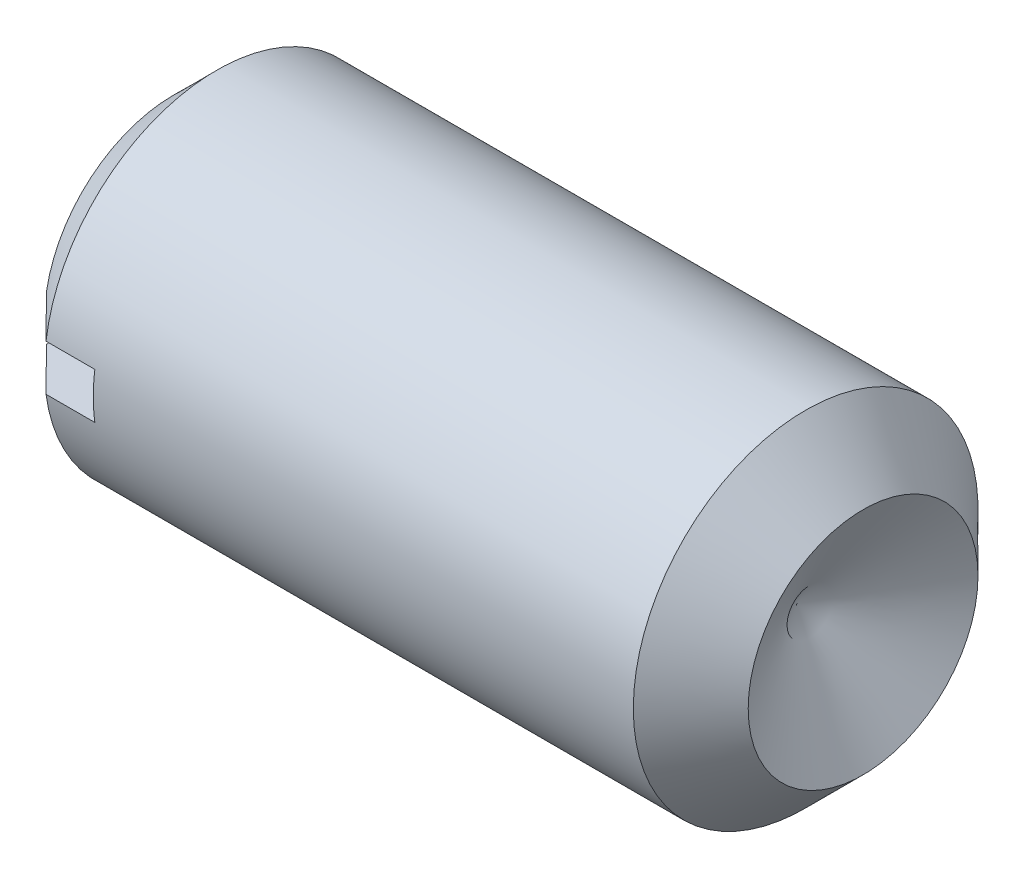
from build123d import *

# Parameters (mm, degrees)
NOTCH_DEPTH      = 7.363961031
NOTCH_DEPTH_BACK = 7.363961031
SKETCH2_W        = 0.8
SKETCH2_H        = 0.4


with BuildPart() as part:
    # Sketch1 → Base (revolve)
    with BuildSketch(Plane.XY, mode=Mode.PRIVATE) as base_sk:
        Polygon((0, 0), (5.422649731, 0), (6, 1), (5.5, 1.5), (0.375, 1.5), (0, 1.125), align=None)
    revolve(base_sk.sketch.rotate(Axis((-10.745014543, 0, 0), (1, 0, 0)), 90), axis=Axis((-10.745014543, 0, 0), (1, 0, 0)))

    # Sketch2 → Notch (cut, two sides: drawn at the far end of the back side and taken through both)
    with BuildSketch(Plane.XY.offset(-NOTCH_DEPTH_BACK)):
        with Locations((0.4, 0)):
            Rectangle(SKETCH2_W, SKETCH2_H)
    extrude(amount=NOTCH_DEPTH + NOTCH_DEPTH_BACK, mode=Mode.SUBTRACT)


solid = part.part
